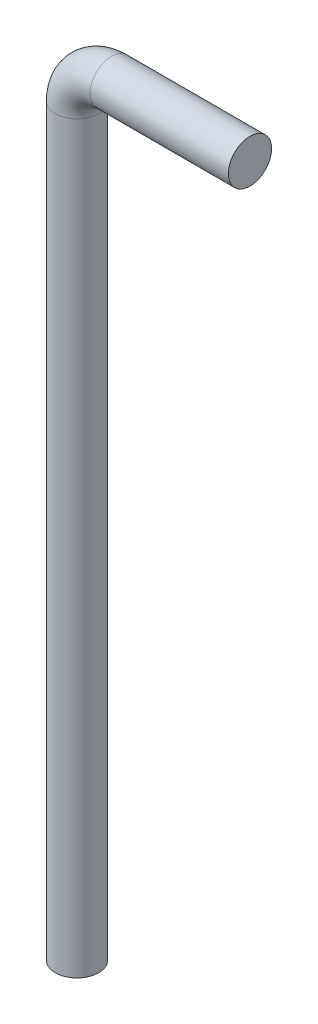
from build123d import *

# Parameters (mm, degrees)
SKETCH_2_R = 1.25


with BuildPart() as part:
    # Sweep 1: sweep along a path in Sketch 1
    with BuildLine(Plane.XY) as sweep_1_path:
        Line((0, 0), (-8, 0))
        ThreePointArc((-8, 0), (-9.414213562, -0.585786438), (-10, -2))
        Line((-10, -2), (-10, -45))
    # Sketch 2 → Sweep 1 (sweep)
    with BuildSketch(Plane(origin=(0, 0, 0), x_dir=(0, 0, -1), z_dir=(1, 0, 0))):
        Circle(SKETCH_2_R)
    sweep(path=sweep_1_path.line)


solid = part.part
